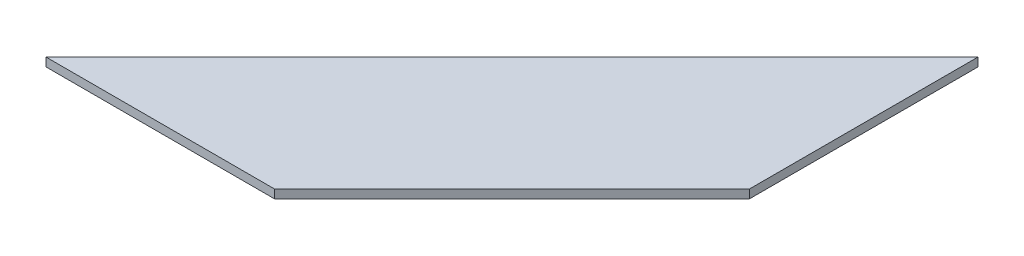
from build123d import *

# Parameters (mm, degrees)
BOSS_EXTRU_1_DEPTH = 3


with BuildPart() as part:
    # Esquisse1 → Boss.-Extru.1 (new body)
    with BuildSketch(Plane(origin=(0, 1.5, 0), x_dir=(1, 0, 0), z_dir=(0, 1, 0))):
        Polygon((-163, 0), (-83, 0), (0, 83), (0, 163), align=None)
    extrude(amount=-BOSS_EXTRU_1_DEPTH)


solid = part.part
